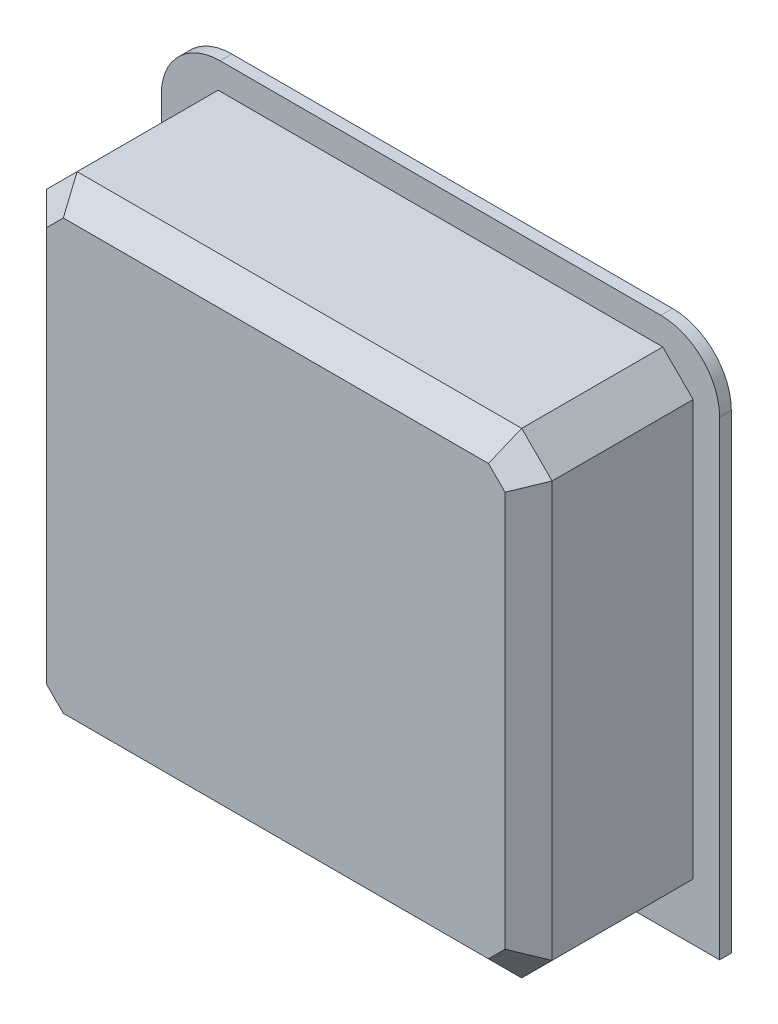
from build123d import *

# Parameters (mm, degrees)
SKETCH2_W           = 95
SKETCH2_H           = 90
BOSS_EXTRUDE1_DEPTH = 30
CUT_EXTRUDE1_START  = -2
SKETCH6_W           = 95
SKETCH6_H           = 90
CUT_EXTRUDE1_DEPTH  = 2
CUT_EXTRUDE2_START  = -2
SKETCH8_W           = 95
SKETCH8_H           = 90
CUT_EXTRUDE2_DEPTH  = 26
BOSS_EXTRUDE2_DEPTH = 2
CHAMFER1_SIZE       = 4
FILLET2_R           = 10


with BuildPart() as part:
    # Sketch2 → Boss-Extrude1 (new body)
    with BuildSketch(Plane.XY):
        Rectangle(SKETCH2_W, SKETCH2_H)
        Polygon((-37, 38.5), (37, 38.5), (41, 34.5), (41, -34.5), (37, -38.5), (-37, -38.5), (-41, -34.5), (-41, 34.5), align=None, mode=Mode.SUBTRACT)
    extrude(amount=BOSS_EXTRUDE1_DEPTH)

    # Sketch6 → Cut-Extrude1 (cut)
    with BuildSketch(Plane(origin=(0, 0, 0), x_dir=(-1, 0, 0), z_dir=(0, 0, -1)).offset(CUT_EXTRUDE1_START)):
        Rectangle(SKETCH6_W, SKETCH6_H)
        Polygon((-43, 35.328427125), (-37.828427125, 40.5), (37.828427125, 40.5), (43, 35.328427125), (43, -35.328427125), (37.828427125, -40.5), (-37.828427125, -40.5), (-43, -35.328427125), align=None, mode=Mode.SUBTRACT)
    extrude(amount=CUT_EXTRUDE1_DEPTH, mode=Mode.SUBTRACT)

    # Sketch8 → Cut-Extrude2 (cut)
    with BuildSketch(Plane(origin=(0, 0, 2), x_dir=(-1, 0, 0), z_dir=(0, 0, -1)).offset(CUT_EXTRUDE2_START)):
        Rectangle(SKETCH8_W, SKETCH8_H)
        Polygon((-37.828427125, 40.5), (-43, 35.328427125), (-43, -35.328427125), (-37.828427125, -40.5), (37.828427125, -40.5), (43, -35.328427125), (43, 35.328427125), (37.828427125, 40.5), align=None, mode=Mode.SUBTRACT)
    extrude(amount=-CUT_EXTRUDE2_DEPTH, mode=Mode.SUBTRACT)

    # Sketch9 → Boss-Extrude2 (add)
    with BuildSketch(Plane.XY.offset(30)):
        Polygon((-43, 35.328427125), (-37.828427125, 40.5), (37.828427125, 40.5), (43, 35.328427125), (43, -35.328427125), (37.828427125, -40.5), (-37.828427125, -40.5), (-43, -35.328427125), align=None)
    extrude(amount=BOSS_EXTRUDE2_DEPTH)

    # Chamfer1
    chamfer1_edges = [part.edges().sort_by_distance(p)[0] for p in [
        (-43, 0, 32),
        (-40.414213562, -37.914213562, 32),
        (0, -40.5, 32),
        (40.414213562, -37.914213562, 32),
        (43, 0, 32),
        (40.414213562, 37.914213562, 32),
        (0, 40.5, 32),
        (-40.414213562, 37.914213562, 32),
    ]]
    chamfer(chamfer1_edges, length=CHAMFER1_SIZE)

    # Fillet2
    fillet2_edges = [part.edges().sort_by_distance(p)[0] for p in [
        (-47.5, 45, 3),
        (47.5, 45, 3),
    ]]
    fillet(fillet2_edges, radius=FILLET2_R)


solid = part.part
